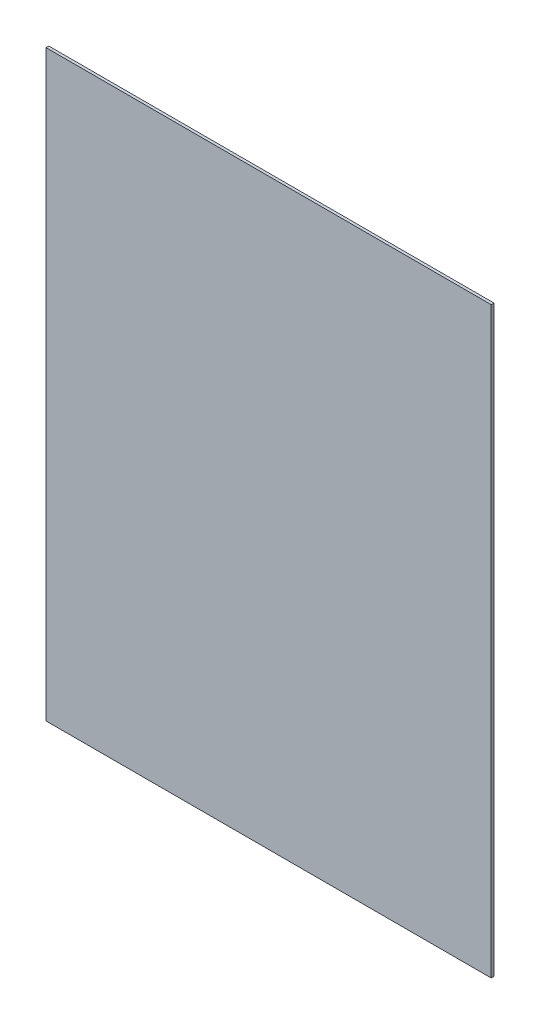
ISO-10303-21;
HEADER;
FILE_DESCRIPTION(('STEP AP214'),'2;1');
FILE_NAME('part.step','',(''),(''),'','','');
FILE_SCHEMA(('AUTOMOTIVE_DESIGN { 1 0 10303 214 1 1 1 1 }'));
ENDSEC;
DATA;
#1=APPLICATION_CONTEXT('core data for automotive mechanical design processes');
#2=APPLICATION_PROTOCOL_DEFINITION('international standard','automotive_design',2000,#1);
#3=PRODUCT_CONTEXT('',#1,'mechanical');
#4=PRODUCT('Part','Part','',(#3));
#5=PRODUCT_RELATED_PRODUCT_CATEGORY('part','',(#4));
#6=PRODUCT_DEFINITION_FORMATION('','',#4);
#7=PRODUCT_DEFINITION_CONTEXT('part definition',#1,'design');
#8=PRODUCT_DEFINITION('design','',#6,#7);
#9=PRODUCT_DEFINITION_SHAPE('','',#8);
#10=(LENGTH_UNIT() NAMED_UNIT(*) SI_UNIT(.MILLI.,.METRE.));
#11=(NAMED_UNIT(*) PLANE_ANGLE_UNIT() SI_UNIT($,.RADIAN.));
#12=(NAMED_UNIT(*) SI_UNIT($,.STERADIAN.) SOLID_ANGLE_UNIT());
#13=UNCERTAINTY_MEASURE_WITH_UNIT(LENGTH_MEASURE(1.E-05),#10,'distance_accuracy_value','');
#14=(GEOMETRIC_REPRESENTATION_CONTEXT(3) GLOBAL_UNCERTAINTY_ASSIGNED_CONTEXT((#13)) GLOBAL_UNIT_ASSIGNED_CONTEXT((#10,
#11,#12)) REPRESENTATION_CONTEXT('',''));
#15=CARTESIAN_POINT('',(0.,0.,0.));
#16=DIRECTION('',(0.,0.,1.));
#17=DIRECTION('',(1.,0.,0.));
#18=AXIS2_PLACEMENT_3D('',#15,#16,#17);
#19=CARTESIAN_POINT('',(0.,0.,3.));
#20=DIRECTION('',(1.,0.,0.));
#21=DIRECTION('',(0.,0.,-1.));
#22=AXIS2_PLACEMENT_3D('',#19,#20,#21);
#23=PLANE('',#22);
#24=DIRECTION('',(0.,-1.,0.));
#25=VECTOR('',#24,1.);
#26=CARTESIAN_POINT('',(0.,0.,0.));
#27=LINE('',#26,#25);
#28=CARTESIAN_POINT('',(0.,630.,0.));
#29=VERTEX_POINT('',#28);
#30=CARTESIAN_POINT('',(0.,0.,0.));
#31=VERTEX_POINT('',#30);
#32=EDGE_CURVE('E113',#29,#31,#27,.T.);
#33=ORIENTED_EDGE('',*,*,#32,.T.);
#34=DIRECTION('',(0.,0.,-1.));
#35=VECTOR('',#34,1.);
#36=CARTESIAN_POINT('',(0.,0.,3.));
#37=LINE('',#36,#35);
#38=CARTESIAN_POINT('',(0.,0.,3.));
#39=VERTEX_POINT('',#38);
#40=EDGE_CURVE('E11',#39,#31,#37,.T.);
#41=ORIENTED_EDGE('',*,*,#40,.F.);
#42=DIRECTION('',(0.,-1.,0.));
#43=VECTOR('',#42,1.);
#44=CARTESIAN_POINT('',(0.,0.,3.));
#45=LINE('',#44,#43);
#46=CARTESIAN_POINT('',(0.,630.,3.));
#47=VERTEX_POINT('',#46);
#48=EDGE_CURVE('E97',#47,#39,#45,.T.);
#49=ORIENTED_EDGE('',*,*,#48,.F.);
#50=DIRECTION('',(0.,0.,-1.));
#51=VECTOR('',#50,1.);
#52=CARTESIAN_POINT('',(0.,630.,3.));
#53=LINE('',#52,#51);
#54=EDGE_CURVE('E109',#47,#29,#53,.T.);
#55=ORIENTED_EDGE('',*,*,#54,.T.);
#56=EDGE_LOOP('',(#33,#41,#49,#55));
#57=FACE_BOUND('',#56,.T.);
#58=ADVANCED_FACE('F45',(#57),#23,.F.);
#59=CARTESIAN_POINT('',(0.,0.,3.));
#60=DIRECTION('',(0.,1.,0.));
#61=DIRECTION('',(0.,0.,1.));
#62=AXIS2_PLACEMENT_3D('',#59,#60,#61);
#63=PLANE('',#62);
#64=DIRECTION('',(1.,0.,0.));
#65=VECTOR('',#64,1.);
#66=CARTESIAN_POINT('',(0.,0.,0.));
#67=LINE('',#66,#65);
#68=CARTESIAN_POINT('',(481.,0.,0.));
#69=VERTEX_POINT('',#68);
#70=EDGE_CURVE('E102',#31,#69,#67,.T.);
#71=ORIENTED_EDGE('',*,*,#70,.T.);
#72=DIRECTION('',(0.,0.,-1.));
#73=VECTOR('',#72,1.);
#74=CARTESIAN_POINT('',(481.,0.,3.));
#75=LINE('',#74,#73);
#76=CARTESIAN_POINT('',(481.,0.,3.));
#77=VERTEX_POINT('',#76);
#78=EDGE_CURVE('E54',#77,#69,#75,.T.);
#79=ORIENTED_EDGE('',*,*,#78,.F.);
#80=DIRECTION('',(1.,0.,0.));
#81=VECTOR('',#80,1.);
#82=CARTESIAN_POINT('',(0.,0.,3.));
#83=LINE('',#82,#81);
#84=EDGE_CURVE('E92',#39,#77,#83,.T.);
#85=ORIENTED_EDGE('',*,*,#84,.F.);
#86=ORIENTED_EDGE('',*,*,#40,.T.);
#87=EDGE_LOOP('',(#71,#79,#85,#86));
#88=FACE_BOUND('',#87,.T.);
#89=ADVANCED_FACE('F101',(#88),#63,.F.);
#90=CARTESIAN_POINT('',(481.,0.,3.));
#91=DIRECTION('',(-1.,0.,0.));
#92=DIRECTION('',(0.,0.,1.));
#93=AXIS2_PLACEMENT_3D('',#90,#91,#92);
#94=PLANE('',#93);
#95=DIRECTION('',(0.,1.,0.));
#96=VECTOR('',#95,1.);
#97=CARTESIAN_POINT('',(481.,0.,0.));
#98=LINE('',#97,#96);
#99=CARTESIAN_POINT('',(481.,630.,0.));
#100=VERTEX_POINT('',#99);
#101=EDGE_CURVE('E79',#69,#100,#98,.T.);
#102=ORIENTED_EDGE('',*,*,#101,.T.);
#103=DIRECTION('',(0.,0.,-1.));
#104=VECTOR('',#103,1.);
#105=CARTESIAN_POINT('',(481.,630.,3.));
#106=LINE('',#105,#104);
#107=CARTESIAN_POINT('',(481.,630.,3.));
#108=VERTEX_POINT('',#107);
#109=EDGE_CURVE('E104',#108,#100,#106,.T.);
#110=ORIENTED_EDGE('',*,*,#109,.F.);
#111=DIRECTION('',(0.,1.,0.));
#112=VECTOR('',#111,1.);
#113=CARTESIAN_POINT('',(481.,0.,3.));
#114=LINE('',#113,#112);
#115=EDGE_CURVE('E95',#77,#108,#114,.T.);
#116=ORIENTED_EDGE('',*,*,#115,.F.);
#117=ORIENTED_EDGE('',*,*,#78,.T.);
#118=EDGE_LOOP('',(#102,#110,#116,#117));
#119=FACE_BOUND('',#118,.T.);
#120=ADVANCED_FACE('F105',(#119),#94,.F.);
#121=CARTESIAN_POINT('',(0.,630.,3.));
#122=DIRECTION('',(0.,-1.,0.));
#123=DIRECTION('',(0.,0.,-1.));
#124=AXIS2_PLACEMENT_3D('',#121,#122,#123);
#125=PLANE('',#124);
#126=DIRECTION('',(-1.,0.,0.));
#127=VECTOR('',#126,1.);
#128=CARTESIAN_POINT('',(0.,630.,0.));
#129=LINE('',#128,#127);
#130=EDGE_CURVE('E85',#100,#29,#129,.T.);
#131=ORIENTED_EDGE('',*,*,#130,.T.);
#132=ORIENTED_EDGE('',*,*,#54,.F.);
#133=DIRECTION('',(-1.,0.,0.));
#134=VECTOR('',#133,1.);
#135=CARTESIAN_POINT('',(0.,630.,3.));
#136=LINE('',#135,#134);
#137=EDGE_CURVE('E62',#108,#47,#136,.T.);
#138=ORIENTED_EDGE('',*,*,#137,.F.);
#139=ORIENTED_EDGE('',*,*,#109,.T.);
#140=EDGE_LOOP('',(#131,#132,#138,#139));
#141=FACE_BOUND('',#140,.T.);
#142=ADVANCED_FACE('F126',(#141),#125,.F.);
#143=CARTESIAN_POINT('',(0.,0.,3.));
#144=DIRECTION('',(0.,0.,-1.));
#145=DIRECTION('',(-1.,0.,0.));
#146=AXIS2_PLACEMENT_3D('',#143,#144,#145);
#147=PLANE('',#146);
#148=ORIENTED_EDGE('',*,*,#48,.T.);
#149=ORIENTED_EDGE('',*,*,#84,.T.);
#150=ORIENTED_EDGE('',*,*,#115,.T.);
#151=ORIENTED_EDGE('',*,*,#137,.T.);
#152=EDGE_LOOP('',(#148,#149,#150,#151));
#153=FACE_BOUND('',#152,.T.);
#154=ADVANCED_FACE('F93',(#153),#147,.F.);
#155=CARTESIAN_POINT('',(0.,0.,0.));
#156=DIRECTION('',(0.,0.,-1.));
#157=DIRECTION('',(-1.,0.,0.));
#158=AXIS2_PLACEMENT_3D('',#155,#156,#157);
#159=PLANE('',#158);
#160=ORIENTED_EDGE('',*,*,#32,.F.);
#161=ORIENTED_EDGE('',*,*,#130,.F.);
#162=ORIENTED_EDGE('',*,*,#101,.F.);
#163=ORIENTED_EDGE('',*,*,#70,.F.);
#164=EDGE_LOOP('',(#160,#161,#162,#163));
#165=FACE_BOUND('',#164,.T.);
#166=ADVANCED_FACE('F129',(#165),#159,.T.);
#167=CLOSED_SHELL('',(#58,#89,#120,#142,#154,#166));
#168=MANIFOLD_SOLID_BREP('B2',#167);
#169=ADVANCED_BREP_SHAPE_REPRESENTATION('',(#18,#168),#14);
#170=SHAPE_DEFINITION_REPRESENTATION(#9,#169);
ENDSEC;
END-ISO-10303-21;
